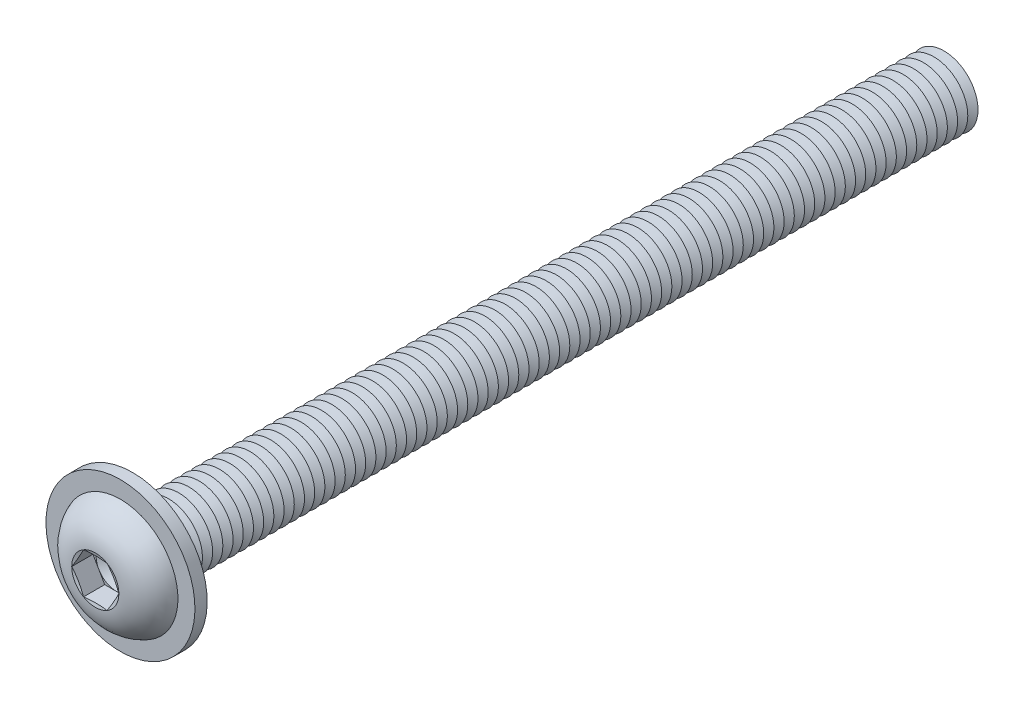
from build123d import *

# Parameters (mm, degrees)
FILLET1_R           = 0.75
LPATTERN1_COUNT     = 80
LPATTERN1_PITCH     = 1.5
CUT_EXTRUDE1_DEPTH  = 3.12
SKETCH5_R           = 10.95
SKETCH5_R_2         = 5.75
BOSS_EXTRUDE1_DEPTH = 1.8


with BuildPart() as part:
    # Sketch1 → Revolve1 (revolve)
    with BuildSketch(Plane(origin=(0, 0, 0), x_dir=(0, 0, -1), z_dir=(1, 0, 0)), mode=Mode.PRIVATE) as revolve1_sk:
        with BuildLine():
            Line((0, 5), (0, 8.75))
            ThreePointArc((0, 8.75), (-3.814142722, 7.21429474), (-5.5, 3.4641))
            Line((-5.5, 3.4641), (-5.035898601, 1.73205))
            Line((-5.035898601, 1.73205), (-5.5, 1.73205))
            Line((-5.5, 1.73205), (-5.5, 0))
            Line((-5.5, 0), (120, 0))
            Line((120, 0), (120, 5))
            Line((120, 5), (0, 5))
        make_face()
    revolve(revolve1_sk.sketch.rotate(Axis((0, 0, -120), (0, 0, 1)), 90), axis=Axis((0, 0, -120), (0, 0, 1)))

    # Fillet1
    fillet1_edges = [part.edges().sort_by_distance(p)[0] for p in [
        (5, 0, 0),
    ]]
    fillet(fillet1_edges, radius=FILLET1_R)

    # Sketch2 → Cut-Revolve1 (revolve, cut)
    with BuildSketch(Plane(origin=(0, 0, 0), x_dir=(0, 0, -1), z_dir=(1, 0, 0)), mode=Mode.PRIVATE) as cut_revolve1_sk:
        Polygon((119.25, 5), (120.75, 5), (120, 3.700961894), align=None)
    cut_revolve1 = revolve(cut_revolve1_sk.sketch.rotate(Axis((0, 0, -120), (0, 0, -1)), 270), axis=Axis((0, 0, -120), (0, 0, -1)), mode=Mode.SUBTRACT)

    # LPattern1: Cut-Revolve1 ×80
    with Locations(*[(0, 0, i * LPATTERN1_PITCH) for i in range(1, LPATTERN1_COUNT)]):
        add(cut_revolve1, mode=Mode.SUBTRACT)

    # Sketch3 → Cut-Extrude1 (cut)
    with BuildSketch(Plane.XY.offset(5.5)):
        Polygon((1.73205, 2.999998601), (-1.73205, 2.999998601), (-3.4641, 0), (-1.73205, -2.999998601), (1.73205, -2.999998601), (3.4641, 0), align=None)
    extrude(amount=-CUT_EXTRUDE1_DEPTH, mode=Mode.SUBTRACT)

    # Cut-Extrude2 cone 1 section (on through the dimple's axis) → Cut-Extrude2 (revolve, cut)
    with BuildSketch(Plane(origin=(0, 0, 2.38), x_dir=(0, -1, 0), z_dir=(1, 0, 0))):
        Polygon((0, 0), (2.999998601, 0), (0, 1.73205), align=None)
    revolve(axis=Axis((0, 0, 2.38), (0, 0, -1)), mode=Mode.SUBTRACT)

    # Sketch5 → Boss-Extrude1 (add)
    with BuildSketch(Plane(origin=(0, 0, 0), x_dir=(-1, 0, 0), z_dir=(0, 0, -1))):
        with Locations(Location((0, 0, 0), (0, 0, 90))):
            Circle(SKETCH5_R)
        Circle(SKETCH5_R_2, mode=Mode.SUBTRACT)
    extrude(amount=-BOSS_EXTRUDE1_DEPTH)


solid = part.part
